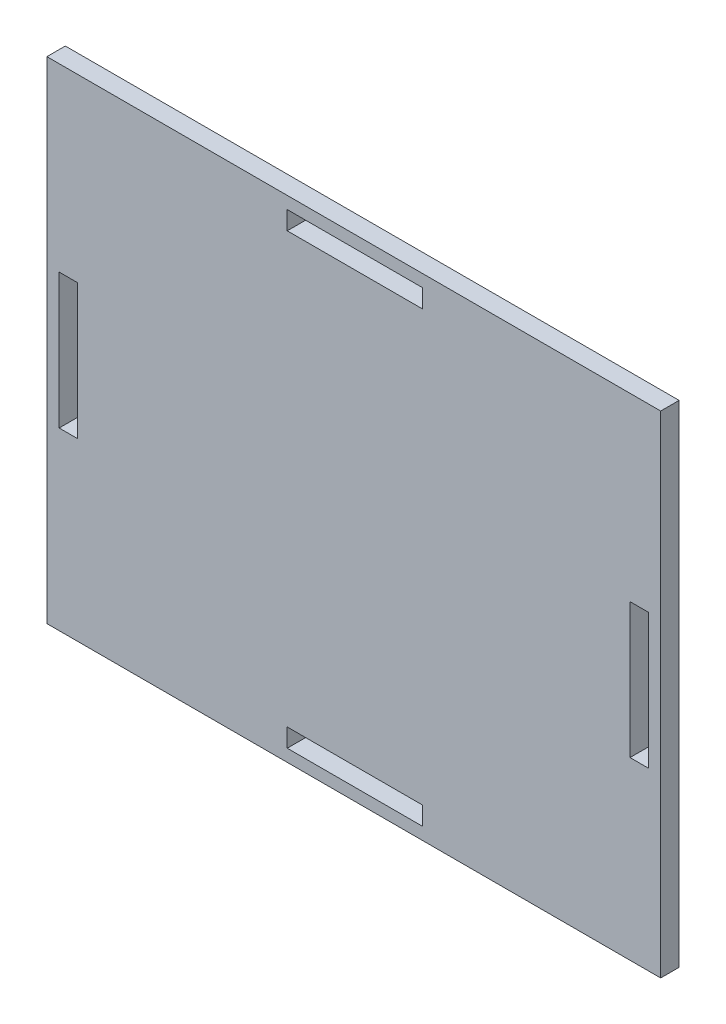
ISO-10303-21;
HEADER;
FILE_DESCRIPTION(('STEP AP214'),'2;1');
FILE_NAME('part.step','',(''),(''),'','','');
FILE_SCHEMA(('AUTOMOTIVE_DESIGN { 1 0 10303 214 1 1 1 1 }'));
ENDSEC;
DATA;
#1=APPLICATION_CONTEXT('core data for automotive mechanical design processes');
#2=APPLICATION_PROTOCOL_DEFINITION('international standard','automotive_design',2000,#1);
#3=PRODUCT_CONTEXT('',#1,'mechanical');
#4=PRODUCT('Part','Part','',(#3));
#5=PRODUCT_RELATED_PRODUCT_CATEGORY('part','',(#4));
#6=PRODUCT_DEFINITION_FORMATION('','',#4);
#7=PRODUCT_DEFINITION_CONTEXT('part definition',#1,'design');
#8=PRODUCT_DEFINITION('design','',#6,#7);
#9=PRODUCT_DEFINITION_SHAPE('','',#8);
#10=(LENGTH_UNIT() NAMED_UNIT(*) SI_UNIT(.MILLI.,.METRE.));
#11=(NAMED_UNIT(*) PLANE_ANGLE_UNIT() SI_UNIT($,.RADIAN.));
#12=(NAMED_UNIT(*) SI_UNIT($,.STERADIAN.) SOLID_ANGLE_UNIT());
#13=UNCERTAINTY_MEASURE_WITH_UNIT(LENGTH_MEASURE(1.E-05),#10,'distance_accuracy_value','');
#14=(GEOMETRIC_REPRESENTATION_CONTEXT(3) GLOBAL_UNCERTAINTY_ASSIGNED_CONTEXT((#13)) GLOBAL_UNIT_ASSIGNED_CONTEXT((#10,
#11,#12)) REPRESENTATION_CONTEXT('',''));
#15=CARTESIAN_POINT('',(0.,0.,0.));
#16=DIRECTION('',(0.,0.,1.));
#17=DIRECTION('',(1.,0.,0.));
#18=AXIS2_PLACEMENT_3D('',#15,#16,#17);
#19=CARTESIAN_POINT('',(0.,0.,3.));
#20=DIRECTION('',(0.,0.,-1.));
#21=DIRECTION('',(-1.,0.,0.));
#22=AXIS2_PLACEMENT_3D('',#19,#20,#21);
#23=PLANE('',#22);
#24=DIRECTION('',(0.,1.,0.));
#25=VECTOR('',#24,1.);
#26=CARTESIAN_POINT('',(98.,50.6024733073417,3.));
#27=LINE('',#26,#25);
#28=CARTESIAN_POINT('',(98.,28.6024733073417,3.));
#29=VERTEX_POINT('',#28);
#30=CARTESIAN_POINT('',(98.,50.6024733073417,3.));
#31=VERTEX_POINT('',#30);
#32=EDGE_CURVE('E206',#29,#31,#27,.T.);
#33=ORIENTED_EDGE('',*,*,#32,.F.);
#34=DIRECTION('',(1.,0.,0.));
#35=VECTOR('',#34,1.);
#36=CARTESIAN_POINT('',(98.,28.6024733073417,3.));
#37=LINE('',#36,#35);
#38=CARTESIAN_POINT('',(95.,28.6024733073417,3.));
#39=VERTEX_POINT('',#38);
#40=EDGE_CURVE('E214',#39,#29,#37,.T.);
#41=ORIENTED_EDGE('',*,*,#40,.F.);
#42=DIRECTION('',(0.,-1.,0.));
#43=VECTOR('',#42,1.);
#44=CARTESIAN_POINT('',(95.,50.6024733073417,3.));
#45=LINE('',#44,#43);
#46=CARTESIAN_POINT('',(95.,50.6024733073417,3.));
#47=VERTEX_POINT('',#46);
#48=EDGE_CURVE('E211',#47,#39,#45,.T.);
#49=ORIENTED_EDGE('',*,*,#48,.F.);
#50=DIRECTION('',(-1.,0.,0.));
#51=VECTOR('',#50,1.);
#52=CARTESIAN_POINT('',(98.,50.6024733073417,3.));
#53=LINE('',#52,#51);
#54=EDGE_CURVE('E208',#31,#47,#53,.T.);
#55=ORIENTED_EDGE('',*,*,#54,.F.);
#56=EDGE_LOOP('',(#33,#41,#49,#55));
#57=FACE_BOUND('',#56,.T.);
#58=DIRECTION('',(0.,-1.,0.));
#59=VECTOR('',#58,1.);
#60=CARTESIAN_POINT('',(39.1572187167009,78.,3.));
#61=LINE('',#60,#59);
#62=CARTESIAN_POINT('',(39.1572187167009,78.,3.));
#63=VERTEX_POINT('',#62);
#64=CARTESIAN_POINT('',(39.1572187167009,75.,3.));
#65=VERTEX_POINT('',#64);
#66=EDGE_CURVE('E268',#63,#65,#61,.T.);
#67=ORIENTED_EDGE('',*,*,#66,.F.);
#68=DIRECTION('',(-1.,0.,0.));
#69=VECTOR('',#68,1.);
#70=CARTESIAN_POINT('',(39.1572187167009,78.,3.));
#71=LINE('',#70,#69);
#72=CARTESIAN_POINT('',(61.1572187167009,78.,3.));
#73=VERTEX_POINT('',#72);
#74=EDGE_CURVE('E276',#73,#63,#71,.T.);
#75=ORIENTED_EDGE('',*,*,#74,.F.);
#76=DIRECTION('',(0.,1.,0.));
#77=VECTOR('',#76,1.);
#78=CARTESIAN_POINT('',(61.1572187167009,78.,3.));
#79=LINE('',#78,#77);
#80=CARTESIAN_POINT('',(61.1572187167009,75.,3.));
#81=VERTEX_POINT('',#80);
#82=EDGE_CURVE('E273',#81,#73,#79,.T.);
#83=ORIENTED_EDGE('',*,*,#82,.F.);
#84=DIRECTION('',(1.,0.,0.));
#85=VECTOR('',#84,1.);
#86=CARTESIAN_POINT('',(39.1572187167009,75.,3.));
#87=LINE('',#86,#85);
#88=EDGE_CURVE('E270',#65,#81,#87,.T.);
#89=ORIENTED_EDGE('',*,*,#88,.F.);
#90=EDGE_LOOP('',(#67,#75,#83,#89));
#91=FACE_BOUND('',#90,.T.);
#92=DIRECTION('',(0.,-1.,0.));
#93=VECTOR('',#92,1.);
#94=CARTESIAN_POINT('',(0.,0.,3.));
#95=LINE('',#94,#93);
#96=CARTESIAN_POINT('',(0.,80.,3.));
#97=VERTEX_POINT('',#96);
#98=CARTESIAN_POINT('',(0.,0.,3.));
#99=VERTEX_POINT('',#98);
#100=EDGE_CURVE('E299',#97,#99,#95,.T.);
#101=ORIENTED_EDGE('',*,*,#100,.T.);
#102=DIRECTION('',(1.,0.,0.));
#103=VECTOR('',#102,1.);
#104=CARTESIAN_POINT('',(0.,0.,3.));
#105=LINE('',#104,#103);
#106=CARTESIAN_POINT('',(100.,0.,3.));
#107=VERTEX_POINT('',#106);
#108=EDGE_CURVE('E302',#99,#107,#105,.T.);
#109=ORIENTED_EDGE('',*,*,#108,.T.);
#110=DIRECTION('',(0.,1.,0.));
#111=VECTOR('',#110,1.);
#112=CARTESIAN_POINT('',(100.,0.,3.));
#113=LINE('',#112,#111);
#114=CARTESIAN_POINT('',(100.,80.,3.));
#115=VERTEX_POINT('',#114);
#116=EDGE_CURVE('E305',#107,#115,#113,.T.);
#117=ORIENTED_EDGE('',*,*,#116,.T.);
#118=DIRECTION('',(-1.,0.,0.));
#119=VECTOR('',#118,1.);
#120=CARTESIAN_POINT('',(0.,80.,3.));
#121=LINE('',#120,#119);
#122=EDGE_CURVE('E307',#115,#97,#121,.T.);
#123=ORIENTED_EDGE('',*,*,#122,.T.);
#124=EDGE_LOOP('',(#101,#109,#117,#123));
#125=FACE_BOUND('',#124,.T.);
#126=DIRECTION('',(0.,-1.,0.));
#127=VECTOR('',#126,1.);
#128=CARTESIAN_POINT('',(2.,50.6024733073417,3.));
#129=LINE('',#128,#127);
#130=CARTESIAN_POINT('',(2.,50.6024733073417,3.));
#131=VERTEX_POINT('',#130);
#132=CARTESIAN_POINT('',(2.,28.6024733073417,3.));
#133=VERTEX_POINT('',#132);
#134=EDGE_CURVE('E237',#131,#133,#129,.T.);
#135=ORIENTED_EDGE('',*,*,#134,.F.);
#136=DIRECTION('',(-1.,0.,0.));
#137=VECTOR('',#136,1.);
#138=CARTESIAN_POINT('',(2.,50.6024733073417,3.));
#139=LINE('',#138,#137);
#140=CARTESIAN_POINT('',(5.,50.6024733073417,3.));
#141=VERTEX_POINT('',#140);
#142=EDGE_CURVE('E245',#141,#131,#139,.T.);
#143=ORIENTED_EDGE('',*,*,#142,.F.);
#144=DIRECTION('',(0.,1.,0.));
#145=VECTOR('',#144,1.);
#146=CARTESIAN_POINT('',(5.,50.6024733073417,3.));
#147=LINE('',#146,#145);
#148=CARTESIAN_POINT('',(5.,28.6024733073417,3.));
#149=VERTEX_POINT('',#148);
#150=EDGE_CURVE('E242',#149,#141,#147,.T.);
#151=ORIENTED_EDGE('',*,*,#150,.F.);
#152=DIRECTION('',(1.,0.,0.));
#153=VECTOR('',#152,1.);
#154=CARTESIAN_POINT('',(2.,28.6024733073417,3.));
#155=LINE('',#154,#153);
#156=EDGE_CURVE('E239',#133,#149,#155,.T.);
#157=ORIENTED_EDGE('',*,*,#156,.F.);
#158=EDGE_LOOP('',(#135,#143,#151,#157));
#159=FACE_BOUND('',#158,.T.);
#160=DIRECTION('',(1.,0.,0.));
#161=VECTOR('',#160,1.);
#162=CARTESIAN_POINT('',(39.1572187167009,2.,3.));
#163=LINE('',#162,#161);
#164=CARTESIAN_POINT('',(39.1572187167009,2.,3.));
#165=VERTEX_POINT('',#164);
#166=CARTESIAN_POINT('',(61.1572187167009,2.,3.));
#167=VERTEX_POINT('',#166);
#168=EDGE_CURVE('E170',#165,#167,#163,.T.);
#169=ORIENTED_EDGE('',*,*,#168,.F.);
#170=DIRECTION('',(0.,-1.,0.));
#171=VECTOR('',#170,1.);
#172=CARTESIAN_POINT('',(39.1572187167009,2.,3.));
#173=LINE('',#172,#171);
#174=CARTESIAN_POINT('',(39.1572187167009,5.,3.));
#175=VERTEX_POINT('',#174);
#176=EDGE_CURVE('E192',#175,#165,#173,.T.);
#177=ORIENTED_EDGE('',*,*,#176,.F.);
#178=DIRECTION('',(-1.,0.,0.));
#179=VECTOR('',#178,1.);
#180=CARTESIAN_POINT('',(39.1572187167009,5.,3.));
#181=LINE('',#180,#179);
#182=CARTESIAN_POINT('',(61.1572187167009,5.,3.));
#183=VERTEX_POINT('',#182);
#184=EDGE_CURVE('E190',#183,#175,#181,.T.);
#185=ORIENTED_EDGE('',*,*,#184,.F.);
#186=DIRECTION('',(0.,1.,0.));
#187=VECTOR('',#186,1.);
#188=CARTESIAN_POINT('',(61.1572187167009,2.,3.));
#189=LINE('',#188,#187);
#190=EDGE_CURVE('E178',#167,#183,#189,.T.);
#191=ORIENTED_EDGE('',*,*,#190,.F.);
#192=EDGE_LOOP('',(#169,#177,#185,#191));
#193=FACE_BOUND('',#192,.T.);
#194=ADVANCED_FACE('F33',(#57,#91,#125,#159,#193),#23,.F.);
#195=CARTESIAN_POINT('',(0.,0.,0.));
#196=DIRECTION('',(0.,0.,-1.));
#197=DIRECTION('',(-1.,0.,0.));
#198=AXIS2_PLACEMENT_3D('',#195,#196,#197);
#199=PLANE('',#198);
#200=DIRECTION('',(0.,-1.,0.));
#201=VECTOR('',#200,1.);
#202=CARTESIAN_POINT('',(0.,0.,0.));
#203=LINE('',#202,#201);
#204=CARTESIAN_POINT('',(0.,80.,0.));
#205=VERTEX_POINT('',#204);
#206=CARTESIAN_POINT('',(0.,0.,0.));
#207=VERTEX_POINT('',#206);
#208=EDGE_CURVE('E298',#205,#207,#203,.T.);
#209=ORIENTED_EDGE('',*,*,#208,.F.);
#210=DIRECTION('',(-1.,0.,0.));
#211=VECTOR('',#210,1.);
#212=CARTESIAN_POINT('',(0.,80.,0.));
#213=LINE('',#212,#211);
#214=CARTESIAN_POINT('',(100.,80.,0.));
#215=VERTEX_POINT('',#214);
#216=EDGE_CURVE('E303',#215,#205,#213,.T.);
#217=ORIENTED_EDGE('',*,*,#216,.F.);
#218=DIRECTION('',(0.,1.,0.));
#219=VECTOR('',#218,1.);
#220=CARTESIAN_POINT('',(100.,0.,0.));
#221=LINE('',#220,#219);
#222=CARTESIAN_POINT('',(100.,0.,0.));
#223=VERTEX_POINT('',#222);
#224=EDGE_CURVE('E314',#223,#215,#221,.T.);
#225=ORIENTED_EDGE('',*,*,#224,.F.);
#226=DIRECTION('',(1.,0.,0.));
#227=VECTOR('',#226,1.);
#228=CARTESIAN_POINT('',(0.,0.,0.));
#229=LINE('',#228,#227);
#230=EDGE_CURVE('E312',#207,#223,#229,.T.);
#231=ORIENTED_EDGE('',*,*,#230,.F.);
#232=EDGE_LOOP('',(#209,#217,#225,#231));
#233=FACE_BOUND('',#232,.T.);
#234=DIRECTION('',(-1.,0.,0.));
#235=VECTOR('',#234,1.);
#236=CARTESIAN_POINT('',(39.1572187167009,78.,0.));
#237=LINE('',#236,#235);
#238=CARTESIAN_POINT('',(61.1572187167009,78.,0.));
#239=VERTEX_POINT('',#238);
#240=CARTESIAN_POINT('',(39.1572187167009,78.,0.));
#241=VERTEX_POINT('',#240);
#242=EDGE_CURVE('E271',#239,#241,#237,.T.);
#243=ORIENTED_EDGE('',*,*,#242,.T.);
#244=DIRECTION('',(0.,-1.,0.));
#245=VECTOR('',#244,1.);
#246=CARTESIAN_POINT('',(39.1572187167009,78.,0.));
#247=LINE('',#246,#245);
#248=CARTESIAN_POINT('',(39.1572187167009,75.,0.));
#249=VERTEX_POINT('',#248);
#250=EDGE_CURVE('E267',#241,#249,#247,.T.);
#251=ORIENTED_EDGE('',*,*,#250,.T.);
#252=DIRECTION('',(1.,0.,0.));
#253=VECTOR('',#252,1.);
#254=CARTESIAN_POINT('',(39.1572187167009,75.,0.));
#255=LINE('',#254,#253);
#256=CARTESIAN_POINT('',(61.1572187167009,75.,0.));
#257=VERTEX_POINT('',#256);
#258=EDGE_CURVE('E281',#249,#257,#255,.T.);
#259=ORIENTED_EDGE('',*,*,#258,.T.);
#260=DIRECTION('',(0.,1.,0.));
#261=VECTOR('',#260,1.);
#262=CARTESIAN_POINT('',(61.1572187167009,78.,0.));
#263=LINE('',#262,#261);
#264=EDGE_CURVE('E284',#257,#239,#263,.T.);
#265=ORIENTED_EDGE('',*,*,#264,.T.);
#266=EDGE_LOOP('',(#243,#251,#259,#265));
#267=FACE_BOUND('',#266,.T.);
#268=DIRECTION('',(-1.,0.,0.));
#269=VECTOR('',#268,1.);
#270=CARTESIAN_POINT('',(2.,50.6024733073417,0.));
#271=LINE('',#270,#269);
#272=CARTESIAN_POINT('',(5.,50.6024733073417,0.));
#273=VERTEX_POINT('',#272);
#274=CARTESIAN_POINT('',(2.,50.6024733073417,0.));
#275=VERTEX_POINT('',#274);
#276=EDGE_CURVE('E240',#273,#275,#271,.T.);
#277=ORIENTED_EDGE('',*,*,#276,.T.);
#278=DIRECTION('',(0.,-1.,0.));
#279=VECTOR('',#278,1.);
#280=CARTESIAN_POINT('',(2.,50.6024733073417,0.));
#281=LINE('',#280,#279);
#282=CARTESIAN_POINT('',(2.,28.6024733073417,0.));
#283=VERTEX_POINT('',#282);
#284=EDGE_CURVE('E236',#275,#283,#281,.T.);
#285=ORIENTED_EDGE('',*,*,#284,.T.);
#286=DIRECTION('',(1.,0.,0.));
#287=VECTOR('',#286,1.);
#288=CARTESIAN_POINT('',(2.,28.6024733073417,0.));
#289=LINE('',#288,#287);
#290=CARTESIAN_POINT('',(5.,28.6024733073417,0.));
#291=VERTEX_POINT('',#290);
#292=EDGE_CURVE('E250',#283,#291,#289,.T.);
#293=ORIENTED_EDGE('',*,*,#292,.T.);
#294=DIRECTION('',(0.,1.,0.));
#295=VECTOR('',#294,1.);
#296=CARTESIAN_POINT('',(5.,50.6024733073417,0.));
#297=LINE('',#296,#295);
#298=EDGE_CURVE('E253',#291,#273,#297,.T.);
#299=ORIENTED_EDGE('',*,*,#298,.T.);
#300=EDGE_LOOP('',(#277,#285,#293,#299));
#301=FACE_BOUND('',#300,.T.);
#302=DIRECTION('',(1.,0.,0.));
#303=VECTOR('',#302,1.);
#304=CARTESIAN_POINT('',(98.,28.6024733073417,0.));
#305=LINE('',#304,#303);
#306=CARTESIAN_POINT('',(95.,28.6024733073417,0.));
#307=VERTEX_POINT('',#306);
#308=CARTESIAN_POINT('',(98.,28.6024733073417,0.));
#309=VERTEX_POINT('',#308);
#310=EDGE_CURVE('E209',#307,#309,#305,.T.);
#311=ORIENTED_EDGE('',*,*,#310,.T.);
#312=DIRECTION('',(0.,1.,0.));
#313=VECTOR('',#312,1.);
#314=CARTESIAN_POINT('',(98.,50.6024733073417,0.));
#315=LINE('',#314,#313);
#316=CARTESIAN_POINT('',(98.,50.6024733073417,0.));
#317=VERTEX_POINT('',#316);
#318=EDGE_CURVE('E186',#309,#317,#315,.T.);
#319=ORIENTED_EDGE('',*,*,#318,.T.);
#320=DIRECTION('',(-1.,0.,0.));
#321=VECTOR('',#320,1.);
#322=CARTESIAN_POINT('',(98.,50.6024733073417,0.));
#323=LINE('',#322,#321);
#324=CARTESIAN_POINT('',(95.,50.6024733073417,0.));
#325=VERTEX_POINT('',#324);
#326=EDGE_CURVE('E219',#317,#325,#323,.T.);
#327=ORIENTED_EDGE('',*,*,#326,.T.);
#328=DIRECTION('',(0.,-1.,0.));
#329=VECTOR('',#328,1.);
#330=CARTESIAN_POINT('',(95.,50.6024733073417,0.));
#331=LINE('',#330,#329);
#332=EDGE_CURVE('E222',#325,#307,#331,.T.);
#333=ORIENTED_EDGE('',*,*,#332,.T.);
#334=EDGE_LOOP('',(#311,#319,#327,#333));
#335=FACE_BOUND('',#334,.T.);
#336=DIRECTION('',(0.,-1.,0.));
#337=VECTOR('',#336,1.);
#338=CARTESIAN_POINT('',(39.1572187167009,2.,0.));
#339=LINE('',#338,#337);
#340=CARTESIAN_POINT('',(39.1572187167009,5.,0.));
#341=VERTEX_POINT('',#340);
#342=CARTESIAN_POINT('',(39.1572187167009,2.,0.));
#343=VERTEX_POINT('',#342);
#344=EDGE_CURVE('E179',#341,#343,#339,.T.);
#345=ORIENTED_EDGE('',*,*,#344,.T.);
#346=DIRECTION('',(1.,0.,0.));
#347=VECTOR('',#346,1.);
#348=CARTESIAN_POINT('',(39.1572187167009,2.,0.));
#349=LINE('',#348,#347);
#350=CARTESIAN_POINT('',(61.1572187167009,2.,0.));
#351=VERTEX_POINT('',#350);
#352=EDGE_CURVE('E56',#343,#351,#349,.T.);
#353=ORIENTED_EDGE('',*,*,#352,.T.);
#354=DIRECTION('',(0.,1.,0.));
#355=VECTOR('',#354,1.);
#356=CARTESIAN_POINT('',(61.1572187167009,2.,0.));
#357=LINE('',#356,#355);
#358=CARTESIAN_POINT('',(61.1572187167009,5.,0.));
#359=VERTEX_POINT('',#358);
#360=EDGE_CURVE('E185',#351,#359,#357,.T.);
#361=ORIENTED_EDGE('',*,*,#360,.T.);
#362=DIRECTION('',(-1.,0.,0.));
#363=VECTOR('',#362,1.);
#364=CARTESIAN_POINT('',(39.1572187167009,5.,0.));
#365=LINE('',#364,#363);
#366=EDGE_CURVE('E198',#359,#341,#365,.T.);
#367=ORIENTED_EDGE('',*,*,#366,.T.);
#368=EDGE_LOOP('',(#345,#353,#361,#367));
#369=FACE_BOUND('',#368,.T.);
#370=ADVANCED_FACE('F332',(#233,#267,#301,#335,#369),#199,.T.);
#371=CARTESIAN_POINT('',(0.,0.,3.));
#372=DIRECTION('',(1.,0.,0.));
#373=DIRECTION('',(0.,0.,-1.));
#374=AXIS2_PLACEMENT_3D('',#371,#372,#373);
#375=PLANE('',#374);
#376=ORIENTED_EDGE('',*,*,#208,.T.);
#377=DIRECTION('',(0.,0.,-1.));
#378=VECTOR('',#377,1.);
#379=CARTESIAN_POINT('',(0.,0.,3.));
#380=LINE('',#379,#378);
#381=EDGE_CURVE('E11',#99,#207,#380,.T.);
#382=ORIENTED_EDGE('',*,*,#381,.F.);
#383=ORIENTED_EDGE('',*,*,#100,.F.);
#384=DIRECTION('',(0.,0.,-1.));
#385=VECTOR('',#384,1.);
#386=CARTESIAN_POINT('',(0.,80.,3.));
#387=LINE('',#386,#385);
#388=EDGE_CURVE('E309',#97,#205,#387,.T.);
#389=ORIENTED_EDGE('',*,*,#388,.T.);
#390=EDGE_LOOP('',(#376,#382,#383,#389));
#391=FACE_BOUND('',#390,.T.);
#392=ADVANCED_FACE('F35',(#391),#375,.F.);
#393=CARTESIAN_POINT('',(0.,0.,3.));
#394=DIRECTION('',(0.,1.,0.));
#395=DIRECTION('',(0.,0.,1.));
#396=AXIS2_PLACEMENT_3D('',#393,#394,#395);
#397=PLANE('',#396);
#398=ORIENTED_EDGE('',*,*,#230,.T.);
#399=DIRECTION('',(0.,0.,-1.));
#400=VECTOR('',#399,1.);
#401=CARTESIAN_POINT('',(100.,0.,3.));
#402=LINE('',#401,#400);
#403=EDGE_CURVE('E41',#107,#223,#402,.T.);
#404=ORIENTED_EDGE('',*,*,#403,.F.);
#405=ORIENTED_EDGE('',*,*,#108,.F.);
#406=ORIENTED_EDGE('',*,*,#381,.T.);
#407=EDGE_LOOP('',(#398,#404,#405,#406));
#408=FACE_BOUND('',#407,.T.);
#409=ADVANCED_FACE('F343',(#408),#397,.F.);
#410=CARTESIAN_POINT('',(100.,0.,3.));
#411=DIRECTION('',(-1.,0.,0.));
#412=DIRECTION('',(0.,0.,1.));
#413=AXIS2_PLACEMENT_3D('',#410,#411,#412);
#414=PLANE('',#413);
#415=ORIENTED_EDGE('',*,*,#224,.T.);
#416=DIRECTION('',(0.,0.,-1.));
#417=VECTOR('',#416,1.);
#418=CARTESIAN_POINT('',(100.,80.,3.));
#419=LINE('',#418,#417);
#420=EDGE_CURVE('E319',#115,#215,#419,.T.);
#421=ORIENTED_EDGE('',*,*,#420,.F.);
#422=ORIENTED_EDGE('',*,*,#116,.F.);
#423=ORIENTED_EDGE('',*,*,#403,.T.);
#424=EDGE_LOOP('',(#415,#421,#422,#423));
#425=FACE_BOUND('',#424,.T.);
#426=ADVANCED_FACE('F326',(#425),#414,.F.);
#427=CARTESIAN_POINT('',(0.,80.,3.));
#428=DIRECTION('',(0.,-1.,0.));
#429=DIRECTION('',(0.,0.,-1.));
#430=AXIS2_PLACEMENT_3D('',#427,#428,#429);
#431=PLANE('',#430);
#432=ORIENTED_EDGE('',*,*,#216,.T.);
#433=ORIENTED_EDGE('',*,*,#388,.F.);
#434=ORIENTED_EDGE('',*,*,#122,.F.);
#435=ORIENTED_EDGE('',*,*,#420,.T.);
#436=EDGE_LOOP('',(#432,#433,#434,#435));
#437=FACE_BOUND('',#436,.T.);
#438=ADVANCED_FACE('F336',(#437),#431,.F.);
#439=CARTESIAN_POINT('',(39.1572187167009,78.,3.));
#440=DIRECTION('',(1.,0.,0.));
#441=DIRECTION('',(0.,0.,-1.));
#442=AXIS2_PLACEMENT_3D('',#439,#440,#441);
#443=PLANE('',#442);
#444=ORIENTED_EDGE('',*,*,#250,.F.);
#445=DIRECTION('',(0.,0.,-1.));
#446=VECTOR('',#445,1.);
#447=CARTESIAN_POINT('',(39.1572187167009,78.,3.));
#448=LINE('',#447,#446);
#449=EDGE_CURVE('E278',#63,#241,#448,.T.);
#450=ORIENTED_EDGE('',*,*,#449,.F.);
#451=ORIENTED_EDGE('',*,*,#66,.T.);
#452=DIRECTION('',(0.,0.,-1.));
#453=VECTOR('',#452,1.);
#454=CARTESIAN_POINT('',(39.1572187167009,75.,3.));
#455=LINE('',#454,#453);
#456=EDGE_CURVE('E295',#65,#249,#455,.T.);
#457=ORIENTED_EDGE('',*,*,#456,.T.);
#458=EDGE_LOOP('',(#444,#450,#451,#457));
#459=FACE_BOUND('',#458,.T.);
#460=ADVANCED_FACE('F360',(#459),#443,.T.);
#461=CARTESIAN_POINT('',(39.1572187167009,75.,3.));
#462=DIRECTION('',(0.,1.,0.));
#463=DIRECTION('',(0.,0.,1.));
#464=AXIS2_PLACEMENT_3D('',#461,#462,#463);
#465=PLANE('',#464);
#466=ORIENTED_EDGE('',*,*,#258,.F.);
#467=ORIENTED_EDGE('',*,*,#456,.F.);
#468=ORIENTED_EDGE('',*,*,#88,.T.);
#469=DIRECTION('',(0.,0.,-1.));
#470=VECTOR('',#469,1.);
#471=CARTESIAN_POINT('',(61.1572187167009,75.,3.));
#472=LINE('',#471,#470);
#473=EDGE_CURVE('E293',#81,#257,#472,.T.);
#474=ORIENTED_EDGE('',*,*,#473,.T.);
#475=EDGE_LOOP('',(#466,#467,#468,#474));
#476=FACE_BOUND('',#475,.T.);
#477=ADVANCED_FACE('F367',(#476),#465,.T.);
#478=CARTESIAN_POINT('',(61.1572187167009,78.,3.));
#479=DIRECTION('',(-1.,0.,0.));
#480=DIRECTION('',(0.,0.,1.));
#481=AXIS2_PLACEMENT_3D('',#478,#479,#480);
#482=PLANE('',#481);
#483=ORIENTED_EDGE('',*,*,#264,.F.);
#484=ORIENTED_EDGE('',*,*,#473,.F.);
#485=ORIENTED_EDGE('',*,*,#82,.T.);
#486=DIRECTION('',(0.,0.,-1.));
#487=VECTOR('',#486,1.);
#488=CARTESIAN_POINT('',(61.1572187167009,78.,3.));
#489=LINE('',#488,#487);
#490=EDGE_CURVE('E291',#73,#239,#489,.T.);
#491=ORIENTED_EDGE('',*,*,#490,.T.);
#492=EDGE_LOOP('',(#483,#484,#485,#491));
#493=FACE_BOUND('',#492,.T.);
#494=ADVANCED_FACE('F372',(#493),#482,.T.);
#495=CARTESIAN_POINT('',(39.1572187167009,78.,3.));
#496=DIRECTION('',(0.,-1.,0.));
#497=DIRECTION('',(0.,0.,-1.));
#498=AXIS2_PLACEMENT_3D('',#495,#496,#497);
#499=PLANE('',#498);
#500=ORIENTED_EDGE('',*,*,#242,.F.);
#501=ORIENTED_EDGE('',*,*,#490,.F.);
#502=ORIENTED_EDGE('',*,*,#74,.T.);
#503=ORIENTED_EDGE('',*,*,#449,.T.);
#504=EDGE_LOOP('',(#500,#501,#502,#503));
#505=FACE_BOUND('',#504,.T.);
#506=ADVANCED_FACE('F379',(#505),#499,.T.);
#507=CARTESIAN_POINT('',(2.,50.6024733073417,3.));
#508=DIRECTION('',(1.,0.,0.));
#509=DIRECTION('',(0.,1.,0.));
#510=AXIS2_PLACEMENT_3D('',#507,#508,#509);
#511=PLANE('',#510);
#512=ORIENTED_EDGE('',*,*,#284,.F.);
#513=DIRECTION('',(0.,0.,-1.));
#514=VECTOR('',#513,1.);
#515=CARTESIAN_POINT('',(2.,50.6024733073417,3.));
#516=LINE('',#515,#514);
#517=EDGE_CURVE('E247',#131,#275,#516,.T.);
#518=ORIENTED_EDGE('',*,*,#517,.F.);
#519=ORIENTED_EDGE('',*,*,#134,.T.);
#520=DIRECTION('',(0.,0.,-1.));
#521=VECTOR('',#520,1.);
#522=CARTESIAN_POINT('',(2.,28.6024733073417,3.));
#523=LINE('',#522,#521);
#524=EDGE_CURVE('E264',#133,#283,#523,.T.);
#525=ORIENTED_EDGE('',*,*,#524,.T.);
#526=EDGE_LOOP('',(#512,#518,#519,#525));
#527=FACE_BOUND('',#526,.T.);
#528=ADVANCED_FACE('F392',(#527),#511,.T.);
#529=CARTESIAN_POINT('',(2.,28.6024733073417,3.));
#530=DIRECTION('',(0.,1.,0.));
#531=DIRECTION('',(0.,0.,1.));
#532=AXIS2_PLACEMENT_3D('',#529,#530,#531);
#533=PLANE('',#532);
#534=ORIENTED_EDGE('',*,*,#292,.F.);
#535=ORIENTED_EDGE('',*,*,#524,.F.);
#536=ORIENTED_EDGE('',*,*,#156,.T.);
#537=DIRECTION('',(0.,0.,-1.));
#538=VECTOR('',#537,1.);
#539=CARTESIAN_POINT('',(5.,28.6024733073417,3.));
#540=LINE('',#539,#538);
#541=EDGE_CURVE('E262',#149,#291,#540,.T.);
#542=ORIENTED_EDGE('',*,*,#541,.T.);
#543=EDGE_LOOP('',(#534,#535,#536,#542));
#544=FACE_BOUND('',#543,.T.);
#545=ADVANCED_FACE('F397',(#544),#533,.T.);
#546=CARTESIAN_POINT('',(5.,50.6024733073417,3.));
#547=DIRECTION('',(-1.,0.,0.));
#548=DIRECTION('',(0.,-1.,0.));
#549=AXIS2_PLACEMENT_3D('',#546,#547,#548);
#550=PLANE('',#549);
#551=ORIENTED_EDGE('',*,*,#298,.F.);
#552=ORIENTED_EDGE('',*,*,#541,.F.);
#553=ORIENTED_EDGE('',*,*,#150,.T.);
#554=DIRECTION('',(0.,0.,-1.));
#555=VECTOR('',#554,1.);
#556=CARTESIAN_POINT('',(5.,50.6024733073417,3.));
#557=LINE('',#556,#555);
#558=EDGE_CURVE('E260',#141,#273,#557,.T.);
#559=ORIENTED_EDGE('',*,*,#558,.T.);
#560=EDGE_LOOP('',(#551,#552,#553,#559));
#561=FACE_BOUND('',#560,.T.);
#562=ADVANCED_FACE('F401',(#561),#550,.T.);
#563=CARTESIAN_POINT('',(2.,50.6024733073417,3.));
#564=DIRECTION('',(0.,-1.,0.));
#565=DIRECTION('',(0.,0.,-1.));
#566=AXIS2_PLACEMENT_3D('',#563,#564,#565);
#567=PLANE('',#566);
#568=ORIENTED_EDGE('',*,*,#276,.F.);
#569=ORIENTED_EDGE('',*,*,#558,.F.);
#570=ORIENTED_EDGE('',*,*,#142,.T.);
#571=ORIENTED_EDGE('',*,*,#517,.T.);
#572=EDGE_LOOP('',(#568,#569,#570,#571));
#573=FACE_BOUND('',#572,.T.);
#574=ADVANCED_FACE('F405',(#573),#567,.T.);
#575=CARTESIAN_POINT('',(98.,50.6024733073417,3.));
#576=DIRECTION('',(-1.,0.,0.));
#577=DIRECTION('',(0.,-1.,0.));
#578=AXIS2_PLACEMENT_3D('',#575,#576,#577);
#579=PLANE('',#578);
#580=ORIENTED_EDGE('',*,*,#318,.F.);
#581=DIRECTION('',(0.,0.,-1.));
#582=VECTOR('',#581,1.);
#583=CARTESIAN_POINT('',(98.,28.6024733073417,3.));
#584=LINE('',#583,#582);
#585=EDGE_CURVE('E216',#29,#309,#584,.T.);
#586=ORIENTED_EDGE('',*,*,#585,.F.);
#587=ORIENTED_EDGE('',*,*,#32,.T.);
#588=DIRECTION('',(0.,0.,-1.));
#589=VECTOR('',#588,1.);
#590=CARTESIAN_POINT('',(98.,50.6024733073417,3.));
#591=LINE('',#590,#589);
#592=EDGE_CURVE('E233',#31,#317,#591,.T.);
#593=ORIENTED_EDGE('',*,*,#592,.T.);
#594=EDGE_LOOP('',(#580,#586,#587,#593));
#595=FACE_BOUND('',#594,.T.);
#596=ADVANCED_FACE('F409',(#595),#579,.T.);
#597=CARTESIAN_POINT('',(98.,50.6024733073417,3.));
#598=DIRECTION('',(0.,-1.,0.));
#599=DIRECTION('',(0.,0.,-1.));
#600=AXIS2_PLACEMENT_3D('',#597,#598,#599);
#601=PLANE('',#600);
#602=ORIENTED_EDGE('',*,*,#326,.F.);
#603=ORIENTED_EDGE('',*,*,#592,.F.);
#604=ORIENTED_EDGE('',*,*,#54,.T.);
#605=DIRECTION('',(0.,0.,-1.));
#606=VECTOR('',#605,1.);
#607=CARTESIAN_POINT('',(95.,50.6024733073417,3.));
#608=LINE('',#607,#606);
#609=EDGE_CURVE('E231',#47,#325,#608,.T.);
#610=ORIENTED_EDGE('',*,*,#609,.T.);
#611=EDGE_LOOP('',(#602,#603,#604,#610));
#612=FACE_BOUND('',#611,.T.);
#613=ADVANCED_FACE('F413',(#612),#601,.T.);
#614=CARTESIAN_POINT('',(95.,50.6024733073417,3.));
#615=DIRECTION('',(1.,0.,0.));
#616=DIRECTION('',(0.,1.,0.));
#617=AXIS2_PLACEMENT_3D('',#614,#615,#616);
#618=PLANE('',#617);
#619=ORIENTED_EDGE('',*,*,#332,.F.);
#620=ORIENTED_EDGE('',*,*,#609,.F.);
#621=ORIENTED_EDGE('',*,*,#48,.T.);
#622=DIRECTION('',(0.,0.,-1.));
#623=VECTOR('',#622,1.);
#624=CARTESIAN_POINT('',(95.,28.6024733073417,3.));
#625=LINE('',#624,#623);
#626=EDGE_CURVE('E229',#39,#307,#625,.T.);
#627=ORIENTED_EDGE('',*,*,#626,.T.);
#628=EDGE_LOOP('',(#619,#620,#621,#627));
#629=FACE_BOUND('',#628,.T.);
#630=ADVANCED_FACE('F417',(#629),#618,.T.);
#631=CARTESIAN_POINT('',(98.,28.6024733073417,3.));
#632=DIRECTION('',(0.,1.,0.));
#633=DIRECTION('',(0.,0.,1.));
#634=AXIS2_PLACEMENT_3D('',#631,#632,#633);
#635=PLANE('',#634);
#636=ORIENTED_EDGE('',*,*,#310,.F.);
#637=ORIENTED_EDGE('',*,*,#626,.F.);
#638=ORIENTED_EDGE('',*,*,#40,.T.);
#639=ORIENTED_EDGE('',*,*,#585,.T.);
#640=EDGE_LOOP('',(#636,#637,#638,#639));
#641=FACE_BOUND('',#640,.T.);
#642=ADVANCED_FACE('F421',(#641),#635,.T.);
#643=CARTESIAN_POINT('',(39.1572187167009,2.,3.));
#644=DIRECTION('',(0.,1.,0.));
#645=DIRECTION('',(0.,0.,1.));
#646=AXIS2_PLACEMENT_3D('',#643,#644,#645);
#647=PLANE('',#646);
#648=ORIENTED_EDGE('',*,*,#352,.F.);
#649=DIRECTION('',(0.,0.,-1.));
#650=VECTOR('',#649,1.);
#651=CARTESIAN_POINT('',(39.1572187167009,2.,3.));
#652=LINE('',#651,#650);
#653=EDGE_CURVE('E174',#165,#343,#652,.T.);
#654=ORIENTED_EDGE('',*,*,#653,.F.);
#655=ORIENTED_EDGE('',*,*,#168,.T.);
#656=DIRECTION('',(0.,0.,-1.));
#657=VECTOR('',#656,1.);
#658=CARTESIAN_POINT('',(61.1572187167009,2.,3.));
#659=LINE('',#658,#657);
#660=EDGE_CURVE('E173',#167,#351,#659,.T.);
#661=ORIENTED_EDGE('',*,*,#660,.T.);
#662=EDGE_LOOP('',(#648,#654,#655,#661));
#663=FACE_BOUND('',#662,.T.);
#664=ADVANCED_FACE('F172',(#663),#647,.T.);
#665=CARTESIAN_POINT('',(61.1572187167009,2.,3.));
#666=DIRECTION('',(-1.,0.,0.));
#667=DIRECTION('',(0.,0.,1.));
#668=AXIS2_PLACEMENT_3D('',#665,#666,#667);
#669=PLANE('',#668);
#670=ORIENTED_EDGE('',*,*,#360,.F.);
#671=ORIENTED_EDGE('',*,*,#660,.F.);
#672=ORIENTED_EDGE('',*,*,#190,.T.);
#673=DIRECTION('',(0.,0.,-1.));
#674=VECTOR('',#673,1.);
#675=CARTESIAN_POINT('',(61.1572187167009,5.,3.));
#676=LINE('',#675,#674);
#677=EDGE_CURVE('E187',#183,#359,#676,.T.);
#678=ORIENTED_EDGE('',*,*,#677,.T.);
#679=EDGE_LOOP('',(#670,#671,#672,#678));
#680=FACE_BOUND('',#679,.T.);
#681=ADVANCED_FACE('F182',(#680),#669,.T.);
#682=CARTESIAN_POINT('',(39.1572187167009,5.,3.));
#683=DIRECTION('',(0.,-1.,0.));
#684=DIRECTION('',(0.,0.,-1.));
#685=AXIS2_PLACEMENT_3D('',#682,#683,#684);
#686=PLANE('',#685);
#687=ORIENTED_EDGE('',*,*,#366,.F.);
#688=ORIENTED_EDGE('',*,*,#677,.F.);
#689=ORIENTED_EDGE('',*,*,#184,.T.);
#690=DIRECTION('',(0.,0.,-1.));
#691=VECTOR('',#690,1.);
#692=CARTESIAN_POINT('',(39.1572187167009,5.,3.));
#693=LINE('',#692,#691);
#694=EDGE_CURVE('E48',#175,#341,#693,.T.);
#695=ORIENTED_EDGE('',*,*,#694,.T.);
#696=EDGE_LOOP('',(#687,#688,#689,#695));
#697=FACE_BOUND('',#696,.T.);
#698=ADVANCED_FACE('F430',(#697),#686,.T.);
#699=CARTESIAN_POINT('',(39.1572187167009,2.,3.));
#700=DIRECTION('',(1.,0.,0.));
#701=DIRECTION('',(0.,0.,-1.));
#702=AXIS2_PLACEMENT_3D('',#699,#700,#701);
#703=PLANE('',#702);
#704=ORIENTED_EDGE('',*,*,#344,.F.);
#705=ORIENTED_EDGE('',*,*,#694,.F.);
#706=ORIENTED_EDGE('',*,*,#176,.T.);
#707=ORIENTED_EDGE('',*,*,#653,.T.);
#708=EDGE_LOOP('',(#704,#705,#706,#707));
#709=FACE_BOUND('',#708,.T.);
#710=ADVANCED_FACE('F433',(#709),#703,.T.);
#711=CLOSED_SHELL('',(#194,#370,#392,#409,#426,#438,#460,#477,#494,#506,#528,#545,#562,#574,
#596,#613,#630,#642,#664,#681,#698,#710));
#712=MANIFOLD_SOLID_BREP('B2',#711);
#713=ADVANCED_BREP_SHAPE_REPRESENTATION('',(#18,#712),#14);
#714=SHAPE_DEFINITION_REPRESENTATION(#9,#713);
ENDSEC;
END-ISO-10303-21;
